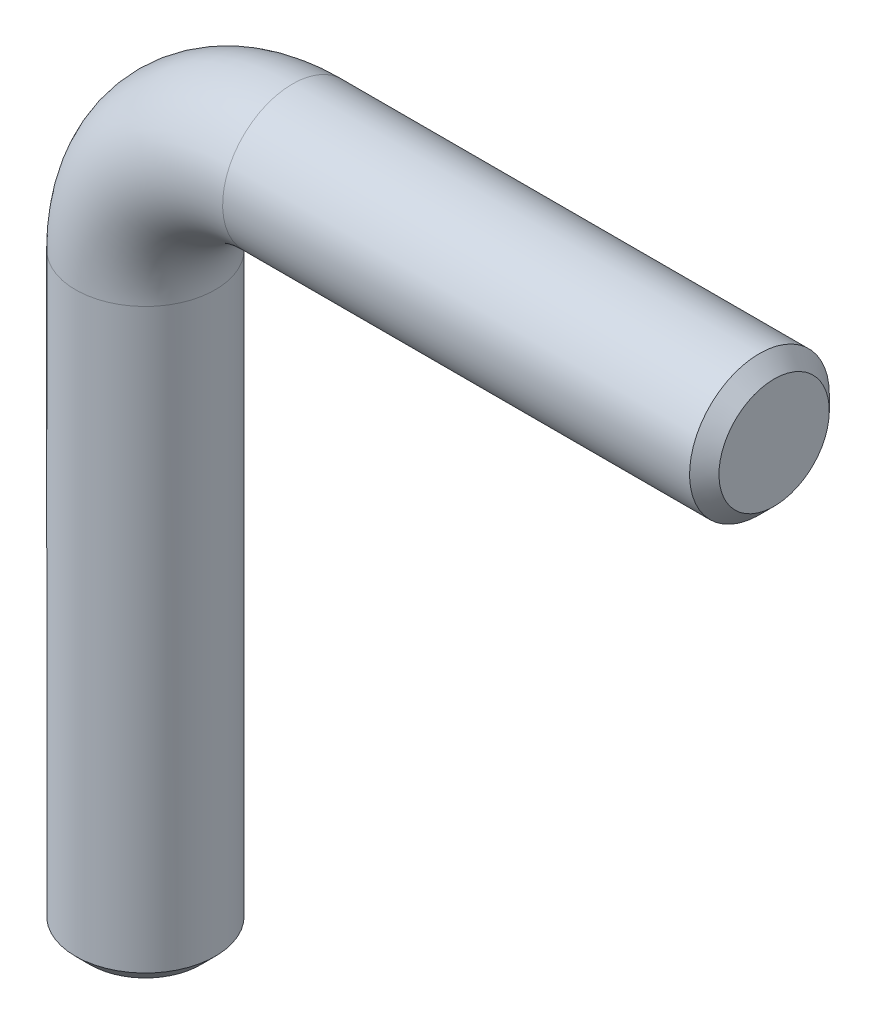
from build123d import *

# Parameters (mm, degrees)
ESBO_O2_R     = 4.75
CHANFRO1_SIZE = 1


with BuildPart() as part:
    # Varredura1: sweep along a path in Esbo_o1
    with BuildLine(Plane.XY) as varredura1_path:
        Line((0, 0), (0, 40.25))
        ThreePointArc((0, 40.25), (2.928932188, 47.321067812), (10, 50.25))
        Line((10, 50.25), (42.75, 50.25))
    # Esbo_o2 → Varredura1 (sweep)
    with BuildSketch(Plane(origin=(0, 0, 0), x_dir=(1, 0, 0), z_dir=(0, 1, 0))):
        Circle(ESBO_O2_R)
    sweep(path=varredura1_path.line)

    # Chanfro1
    chanfro1_edges = [part.edges().sort_by_distance(p)[0] for p in [
        (-4.75, 0, 0),
        (42.75, 55, 0),
    ]]
    chamfer(chanfro1_edges, length=CHANFRO1_SIZE)


solid = part.part
